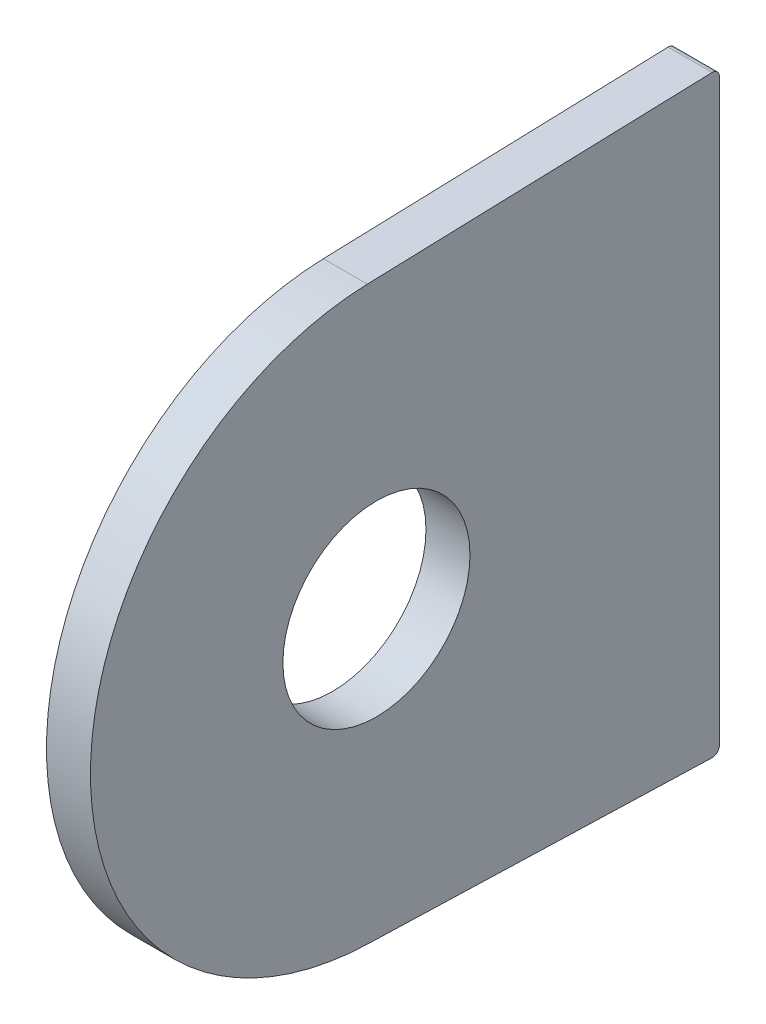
from build123d import *

# Parameters (mm, degrees)
SKETCH1_R             = 6.749999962
BOSS_EXTRUDE1_DEPTH   = 1.5875
FILLET1_R             = 0.508
FILLET2_R             = 0.508
M12_CLEARANCE_HOLE1_D = 13.5


with BuildPart() as part:
    # Sketch1 → Boss-Extrude1 (new, symmetric)
    # profile 1 of 2: a face of its own
    with BuildSketch(Plane(origin=(0, 0, 0), x_dir=(0, 0, -1), z_dir=(1, 0, 0))):
        with BuildLine():
            Line((24.747009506, -21.43125), (-0.652990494, -20.627166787))
            ThreePointArc((-0.652990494, -20.627166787), (-20.6375, 0), (-0.652990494, 20.627166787))
            Line((-0.652990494, 20.627166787), (24.747009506, 21.43125))
            Line((24.747009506, 21.43125), (24.747009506, -21.43125))
        make_face()
        Circle(SKETCH1_R, mode=Mode.SUBTRACT)
    # profile 2 of 2: a face of its own
    with BuildSketch(Plane(origin=(0, 0, 0), x_dir=(0, 0, -1), z_dir=(1, 0, 0))):
        Circle(SKETCH1_R)
    extrude(amount=BOSS_EXTRUDE1_DEPTH, both=True)

    # Fillet1
    fillet1_edges = [part.edges().sort_by_distance(p)[0] for p in [
        (0, -21.43125, -24.747009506),
    ]]
    fillet(fillet1_edges, radius=FILLET1_R)

    # Fillet2
    fillet2_edges = [part.edges().sort_by_distance(p)[0] for p in [
        (0, 21.43125, -24.747009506),
    ]]
    fillet(fillet2_edges, radius=FILLET2_R)

    # M12 Clearance Hole1 (through all)
    with Locations(Plane.ZY.offset(1.5875)):
        with Locations((0, 0)):
            Hole(M12_CLEARANCE_HOLE1_D / 2)


solid = part.part
